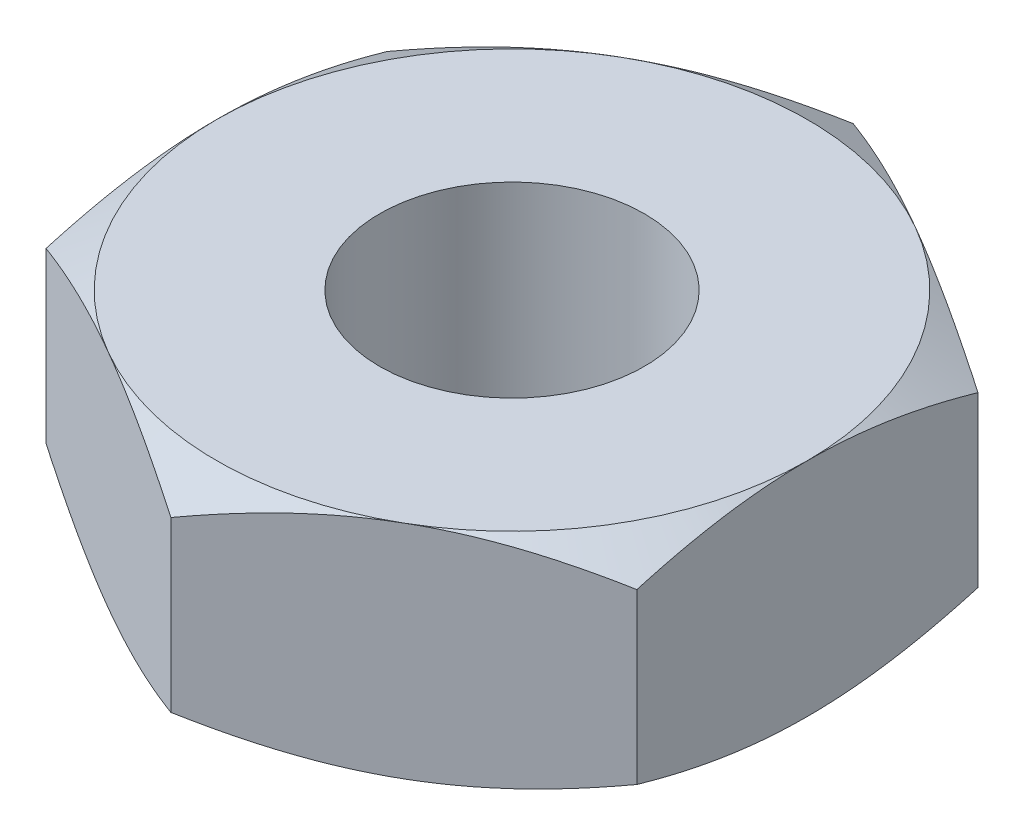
from build123d import *

# Parameters (mm, degrees)
SKETCH1_R               = 1.4224
BOSS_EXTRUDE1_DEPTH     = 1.190625
SKETCH5_OUTSIDE_W       = 32.528
SKETCH5_OUTSIDE_H       = 33.51
SKETCH5_OUTSIDE_R       = 3.175
CUT_EXTRUDE2_DEPTH      = 6.402944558
CUT_EXTRUDE2_DRAFT      = -60
MIRROR1_COPY_1_SKETCH_W = 32.528
MIRROR1_COPY_1_SKETCH_H = 33.51
MIRROR1_COPY_1_SKETCH_R = 3.175
MIRROR1_COPY_1_DEPTH    = 6.402944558
MIRROR1_COPY_1_DRAFT    = -60


with BuildPart() as part:
    # Sketch1 → Boss-Extrude1 (new, symmetric)
    with BuildSketch(Plane(origin=(0, 0, 0), x_dir=(1, 0, 0), z_dir=(0, 1, 0))):
        Polygon((-3.175, 1.833087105), (-3.175, -1.833087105), (0, -3.666174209), (3.175, -1.833087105), (3.175, 1.833087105), (0, 3.666174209), align=None)
        with Locations(Location((0, 0, 0), (0, 0, 90))):
            Circle(SKETCH1_R, mode=Mode.SUBTRACT)
    extrude(amount=BOSS_EXTRUDE1_DEPTH, both=True)


with BuildPart() as cut_extrude2_tool:
    # Sketch5 outside → Cut-Extrude2 (with draft: the straight prism first)
    with BuildSketch(Plane(origin=(0, 1.190625, 0), x_dir=(1, 0, 0), z_dir=(0, 1, 0))):
        Rectangle(SKETCH5_OUTSIDE_W, SKETCH5_OUTSIDE_H)
        Circle(SKETCH5_OUTSIDE_R, mode=Mode.SUBTRACT)
    extrude(amount=-CUT_EXTRUDE2_DEPTH)
    # Cut-Extrude2: the draft: its side faces are tilted about the plane it starts from
    cut_extrude2_sides = [cut_extrude2_tool.faces().sort_by_distance(p)[0] for p in [
        (0, -2.010847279, 16.755),
        (16.264, -2.010847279, 0),
        (0, -2.010847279, -16.755),
        (-16.264, -2.010847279, 0),
        (-3.175, -2.010847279, 0),
    ]]
    draft(cut_extrude2_sides, Plane(origin=(0, 1.190625, 0), x_dir=(1, 0, 0), z_dir=(0, 1, 0)), CUT_EXTRUDE2_DRAFT)


with BuildPart() as part_1:
    add(part.part)

    # Cut-Extrude2: cut by cut_extrude2_tool
    add(cut_extrude2_tool.part, mode=Mode.SUBTRACT)


with BuildPart() as mirror1_copy_1_tool:
    # Mirror1 copy 1 sketch → Mirror1 copy 1 (with draft: the straight prism first)
    with BuildSketch(Plane.XZ.offset(1.190625)):
        Rectangle(MIRROR1_COPY_1_SKETCH_W, MIRROR1_COPY_1_SKETCH_H)
        Circle(MIRROR1_COPY_1_SKETCH_R, mode=Mode.SUBTRACT)
    extrude(amount=-MIRROR1_COPY_1_DEPTH)
    # Mirror1 copy 1: the draft: its side faces are tilted about the plane it starts from
    mirror1_copy_1_sides = [mirror1_copy_1_tool.faces().sort_by_distance(p)[0] for p in [
        (0, 2.010847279, 16.755),
        (16.264, 2.010847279, 0),
        (0, 2.010847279, -16.755),
        (-16.264, 2.010847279, 0),
        (-3.175, 2.010847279, 0),
    ]]
    draft(mirror1_copy_1_sides, Plane.XZ.offset(1.190625), MIRROR1_COPY_1_DRAFT)


with BuildPart() as part_2:
    add(part_1.part)

    # Mirror1 copy 1: cut by mirror1_copy_1_tool
    add(mirror1_copy_1_tool.part, mode=Mode.SUBTRACT)


solid = part_2.part
